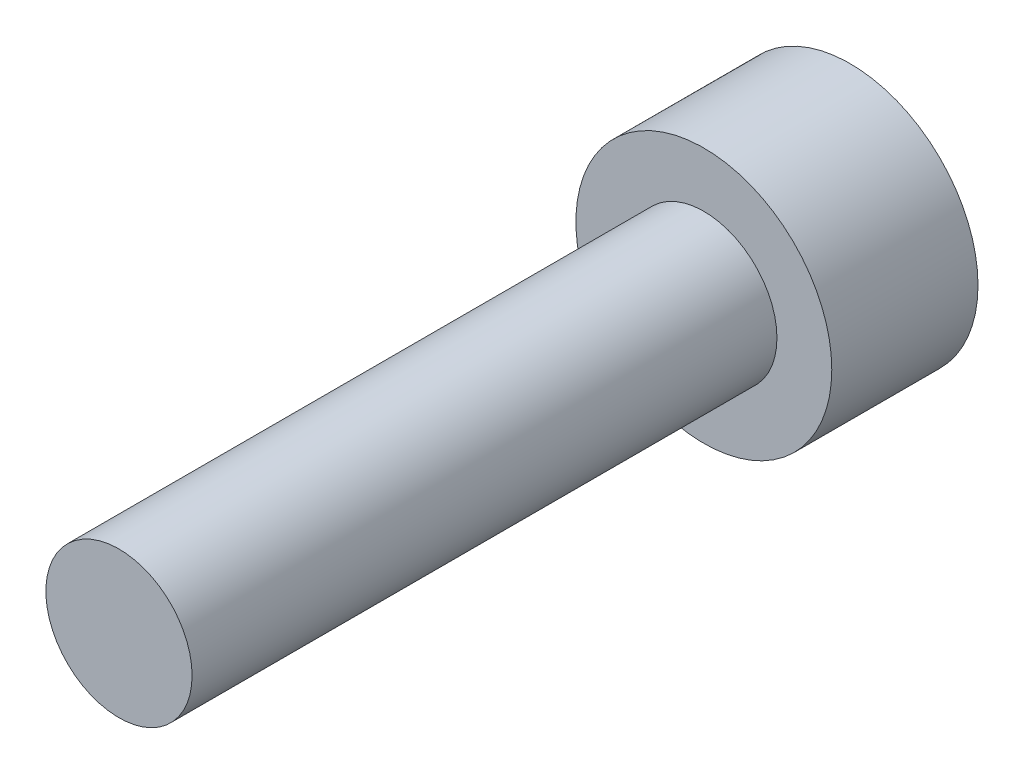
from build123d import *

# Parameters (mm, degrees)
HEX_2_DEPTH = 3


with BuildPart() as part:
    # Sketch6 → Revolve1 (revolve)
    with BuildSketch(Plane(origin=(0, 0, 0), x_dir=(0, 0, -1), z_dir=(1, 0, 0)), mode=Mode.PRIVATE) as revolve1_sk:
        Polygon((-16, 0), (-16, -2), (0, -2), (0, -3.5), (4, -3.5), (4, 0), align=None)
    revolve(revolve1_sk.sketch.rotate(Axis((0, 0, 16), (0, 0, -1)), 270), axis=Axis((0, 0, 16), (0, 0, -1)))

    # Sketch7 → HEX 2 (cut)
    with BuildSketch(Plane(origin=(0, 0, -4), x_dir=(-1, 0, 0), z_dir=(0, 0, -1))):
        Polygon((-1.5, 0.866025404), (-1.5, -0.866025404), (0, -1.732050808), (1.5, -0.866025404), (1.5, 0.866025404), (0, 1.732050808), align=None)
    extrude(amount=-HEX_2_DEPTH, mode=Mode.SUBTRACT)


solid = part.part
